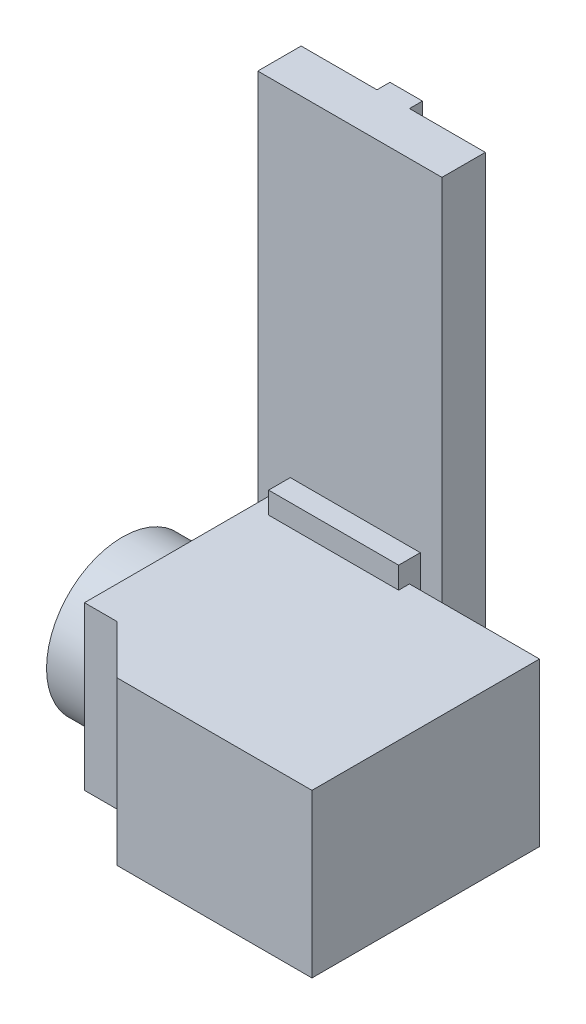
ISO-10303-21;
HEADER;
FILE_DESCRIPTION(('STEP AP214'),'2;1');
FILE_NAME('part.step','',(''),(''),'','','');
FILE_SCHEMA(('AUTOMOTIVE_DESIGN { 1 0 10303 214 1 1 1 1 }'));
ENDSEC;
DATA;
#1=APPLICATION_CONTEXT('core data for automotive mechanical design processes');
#2=APPLICATION_PROTOCOL_DEFINITION('international standard','automotive_design',2000,#1);
#3=PRODUCT_CONTEXT('',#1,'mechanical');
#4=PRODUCT('Part','Part','',(#3));
#5=PRODUCT_RELATED_PRODUCT_CATEGORY('part','',(#4));
#6=PRODUCT_DEFINITION_FORMATION('','',#4);
#7=PRODUCT_DEFINITION_CONTEXT('part definition',#1,'design');
#8=PRODUCT_DEFINITION('design','',#6,#7);
#9=PRODUCT_DEFINITION_SHAPE('','',#8);
#10=(LENGTH_UNIT() NAMED_UNIT(*) SI_UNIT(.MILLI.,.METRE.));
#11=(NAMED_UNIT(*) PLANE_ANGLE_UNIT() SI_UNIT($,.RADIAN.));
#12=(NAMED_UNIT(*) SI_UNIT($,.STERADIAN.) SOLID_ANGLE_UNIT());
#13=UNCERTAINTY_MEASURE_WITH_UNIT(LENGTH_MEASURE(1.E-05),#10,'distance_accuracy_value','');
#14=(GEOMETRIC_REPRESENTATION_CONTEXT(3) GLOBAL_UNCERTAINTY_ASSIGNED_CONTEXT((#13)) GLOBAL_UNIT_ASSIGNED_CONTEXT((#10,
#11,#12)) REPRESENTATION_CONTEXT('',''));
#15=CARTESIAN_POINT('',(0.,0.,0.));
#16=DIRECTION('',(0.,0.,1.));
#17=DIRECTION('',(1.,0.,0.));
#18=AXIS2_PLACEMENT_3D('',#15,#16,#17);
#19=CARTESIAN_POINT('',(-30.,405.,-40.));
#20=DIRECTION('',(0.,0.,-1.));
#21=DIRECTION('',(-1.,0.,0.));
#22=AXIS2_PLACEMENT_3D('',#19,#20,#21);
#23=PLANE('',#22);
#24=DIRECTION('',(0.,1.,0.));
#25=VECTOR('',#24,1.);
#26=CARTESIAN_POINT('',(40.,405.,-40.));
#27=LINE('',#26,#25);
#28=CARTESIAN_POINT('',(40.,-95.,-40.));
#29=VERTEX_POINT('',#28);
#30=CARTESIAN_POINT('',(40.,405.,-40.));
#31=VERTEX_POINT('',#30);
#32=EDGE_CURVE('E11',#29,#31,#27,.T.);
#33=ORIENTED_EDGE('',*,*,#32,.F.);
#34=DIRECTION('',(-1.,0.,0.));
#35=VECTOR('',#34,1.);
#36=CARTESIAN_POINT('',(-30.,-95.,-40.));
#37=LINE('',#36,#35);
#38=CARTESIAN_POINT('',(-30.,-95.,-40.));
#39=VERTEX_POINT('',#38);
#40=EDGE_CURVE('E185',#29,#39,#37,.T.);
#41=ORIENTED_EDGE('',*,*,#40,.T.);
#42=DIRECTION('',(0.,1.,0.));
#43=VECTOR('',#42,1.);
#44=CARTESIAN_POINT('',(-30.,-95.,-40.));
#45=LINE('',#44,#43);
#46=CARTESIAN_POINT('',(-30.,405.,-40.));
#47=VERTEX_POINT('',#46);
#48=EDGE_CURVE('E220',#39,#47,#45,.T.);
#49=ORIENTED_EDGE('',*,*,#48,.T.);
#50=DIRECTION('',(1.,0.,0.));
#51=VECTOR('',#50,1.);
#52=CARTESIAN_POINT('',(-30.,405.,-40.));
#53=LINE('',#52,#51);
#54=EDGE_CURVE('E244',#47,#31,#53,.T.);
#55=ORIENTED_EDGE('',*,*,#54,.T.);
#56=EDGE_LOOP('',(#33,#41,#49,#55));
#57=FACE_BOUND('',#56,.T.);
#58=ADVANCED_FACE('F30',(#57),#23,.T.);
#59=CARTESIAN_POINT('',(-15.,75.,175.));
#60=DIRECTION('',(1.,0.,0.));
#61=DIRECTION('',(0.,0.,-1.));
#62=AXIS2_PLACEMENT_3D('',#59,#60,#61);
#63=PLANE('',#62);
#64=DIRECTION('',(0.,-1.,0.));
#65=VECTOR('',#64,1.);
#66=CARTESIAN_POINT('',(-15.,75.,0.));
#67=LINE('',#66,#65);
#68=CARTESIAN_POINT('',(-15.,75.,0.));
#69=VERTEX_POINT('',#68);
#70=CARTESIAN_POINT('',(-15.,-75.,0.));
#71=VERTEX_POINT('',#70);
#72=EDGE_CURVE('E341',#69,#71,#67,.T.);
#73=ORIENTED_EDGE('',*,*,#72,.T.);
#74=DIRECTION('',(0.,0.,1.));
#75=VECTOR('',#74,1.);
#76=CARTESIAN_POINT('',(-15.,-75.,175.));
#77=LINE('',#76,#75);
#78=CARTESIAN_POINT('',(-15.,-75.,175.));
#79=VERTEX_POINT('',#78);
#80=EDGE_CURVE('E386',#71,#79,#77,.T.);
#81=ORIENTED_EDGE('',*,*,#80,.T.);
#82=DIRECTION('',(0.,-1.,0.));
#83=VECTOR('',#82,1.);
#84=CARTESIAN_POINT('',(-15.,75.,175.));
#85=LINE('',#84,#83);
#86=CARTESIAN_POINT('',(-15.,75.,175.));
#87=VERTEX_POINT('',#86);
#88=EDGE_CURVE('E344',#87,#79,#85,.T.);
#89=ORIENTED_EDGE('',*,*,#88,.F.);
#90=DIRECTION('',(0.,0.,1.));
#91=VECTOR('',#90,1.);
#92=CARTESIAN_POINT('',(-15.,75.,175.));
#93=LINE('',#92,#91);
#94=EDGE_CURVE('E366',#69,#87,#93,.T.);
#95=ORIENTED_EDGE('',*,*,#94,.F.);
#96=EDGE_LOOP('',(#73,#81,#89,#95));
#97=FACE_BOUND('',#96,.T.);
#98=CARTESIAN_POINT('',(-15.,0.,100.));
#99=DIRECTION('',(1.,0.,0.));
#100=DIRECTION('',(0.,0.,-1.));
#101=AXIS2_PLACEMENT_3D('',#98,#99,#100);
#102=CIRCLE('',#101,70.);
#103=CARTESIAN_POINT('',(-15.,0.,30.));
#104=VERTEX_POINT('',#103);
#105=EDGE_CURVE('E284',#104,#104,#102,.F.);
#106=ORIENTED_EDGE('',*,*,#105,.F.);
#107=EDGE_LOOP('',(#106));
#108=FACE_BOUND('',#107,.T.);
#109=ADVANCED_FACE('F418',(#97,#108),#63,.F.);
#110=CARTESIAN_POINT('',(0.,95.,20.));
#111=DIRECTION('',(1.,0.,0.));
#112=DIRECTION('',(0.,0.,-1.));
#113=AXIS2_PLACEMENT_3D('',#110,#111,#112);
#114=PLANE('',#113);
#115=DIRECTION('',(0.,0.,1.));
#116=VECTOR('',#115,1.);
#117=CARTESIAN_POINT('',(0.,-75.,20.));
#118=LINE('',#117,#116);
#119=CARTESIAN_POINT('',(0.,-75.,0.));
#120=VERTEX_POINT('',#119);
#121=CARTESIAN_POINT('',(0.,-75.,20.));
#122=VERTEX_POINT('',#121);
#123=EDGE_CURVE('E332',#120,#122,#118,.T.);
#124=ORIENTED_EDGE('',*,*,#123,.F.);
#125=DIRECTION('',(0.,-1.,0.));
#126=VECTOR('',#125,1.);
#127=CARTESIAN_POINT('',(0.,95.,0.));
#128=LINE('',#127,#126);
#129=CARTESIAN_POINT('',(0.,-95.,0.));
#130=VERTEX_POINT('',#129);
#131=EDGE_CURVE('E280',#120,#130,#128,.T.);
#132=ORIENTED_EDGE('',*,*,#131,.T.);
#133=DIRECTION('',(0.,0.,-1.));
#134=VECTOR('',#133,1.);
#135=CARTESIAN_POINT('',(0.,-95.,20.));
#136=LINE('',#135,#134);
#137=CARTESIAN_POINT('',(0.,-95.,20.));
#138=VERTEX_POINT('',#137);
#139=EDGE_CURVE('E290',#138,#130,#136,.T.);
#140=ORIENTED_EDGE('',*,*,#139,.F.);
#141=DIRECTION('',(0.,-1.,0.));
#142=VECTOR('',#141,1.);
#143=CARTESIAN_POINT('',(0.,95.,20.));
#144=LINE('',#143,#142);
#145=EDGE_CURVE('E277',#122,#138,#144,.T.);
#146=ORIENTED_EDGE('',*,*,#145,.F.);
#147=EDGE_LOOP('',(#124,#132,#140,#146));
#148=FACE_BOUND('',#147,.T.);
#149=ADVANCED_FACE('F409',(#148),#114,.F.);
#150=CARTESIAN_POINT('',(0.,-95.,20.));
#151=DIRECTION('',(0.,0.,1.));
#152=DIRECTION('',(1.,0.,0.));
#153=AXIS2_PLACEMENT_3D('',#150,#151,#152);
#154=PLANE('',#153);
#155=DIRECTION('',(0.,1.,0.));
#156=VECTOR('',#155,1.);
#157=CARTESIAN_POINT('',(120.,95.,20.));
#158=LINE('',#157,#156);
#159=CARTESIAN_POINT('',(120.,-95.,20.));
#160=VERTEX_POINT('',#159);
#161=CARTESIAN_POINT('',(120.,-75.,20.));
#162=VERTEX_POINT('',#161);
#163=EDGE_CURVE('E308',#160,#162,#158,.T.);
#164=ORIENTED_EDGE('',*,*,#163,.T.);
#165=DIRECTION('',(-1.,0.,0.));
#166=VECTOR('',#165,1.);
#167=CARTESIAN_POINT('',(0.,-75.,20.));
#168=LINE('',#167,#166);
#169=EDGE_CURVE('E338',#162,#122,#168,.T.);
#170=ORIENTED_EDGE('',*,*,#169,.T.);
#171=ORIENTED_EDGE('',*,*,#145,.T.);
#172=DIRECTION('',(1.,0.,0.));
#173=VECTOR('',#172,1.);
#174=CARTESIAN_POINT('',(0.,-95.,20.));
#175=LINE('',#174,#173);
#176=EDGE_CURVE('E305',#138,#160,#175,.T.);
#177=ORIENTED_EDGE('',*,*,#176,.T.);
#178=EDGE_LOOP('',(#164,#170,#171,#177));
#179=FACE_BOUND('',#178,.T.);
#180=ADVANCED_FACE('F424',(#179),#154,.T.);
#181=CARTESIAN_POINT('',(0.,95.,0.));
#182=VERTEX_POINT('',#181);
#183=CARTESIAN_POINT('',(0.,75.,0.));
#184=VERTEX_POINT('',#183);
#185=EDGE_CURVE('E275',#182,#184,#128,.T.);
#186=ORIENTED_EDGE('',*,*,#185,.T.);
#187=DIRECTION('',(0.,0.,1.));
#188=VECTOR('',#187,1.);
#189=CARTESIAN_POINT('',(0.,75.,20.));
#190=LINE('',#189,#188);
#191=CARTESIAN_POINT('',(0.,75.,20.));
#192=VERTEX_POINT('',#191);
#193=EDGE_CURVE('E296',#184,#192,#190,.T.);
#194=ORIENTED_EDGE('',*,*,#193,.T.);
#195=CARTESIAN_POINT('',(0.,95.,20.));
#196=VERTEX_POINT('',#195);
#197=EDGE_CURVE('E302',#196,#192,#144,.T.);
#198=ORIENTED_EDGE('',*,*,#197,.F.);
#199=DIRECTION('',(0.,0.,-1.));
#200=VECTOR('',#199,1.);
#201=CARTESIAN_POINT('',(0.,95.,20.));
#202=LINE('',#201,#200);
#203=EDGE_CURVE('E313',#196,#182,#202,.T.);
#204=ORIENTED_EDGE('',*,*,#203,.T.);
#205=EDGE_LOOP('',(#186,#194,#198,#204));
#206=FACE_BOUND('',#205,.T.);
#207=ADVANCED_FACE('F32',(#206),#114,.F.);
#208=CARTESIAN_POINT('',(0.,-95.,20.));
#209=DIRECTION('',(0.,1.,0.));
#210=DIRECTION('',(0.,0.,1.));
#211=AXIS2_PLACEMENT_3D('',#208,#209,#210);
#212=PLANE('',#211);
#213=ORIENTED_EDGE('',*,*,#40,.F.);
#214=DIRECTION('',(0.,0.,-1.));
#215=VECTOR('',#214,1.);
#216=CARTESIAN_POINT('',(40.,-95.,-52.));
#217=LINE('',#216,#215);
#218=CARTESIAN_POINT('',(40.,-95.,-52.));
#219=VERTEX_POINT('',#218);
#220=EDGE_CURVE('E178',#29,#219,#217,.T.);
#221=ORIENTED_EDGE('',*,*,#220,.T.);
#222=DIRECTION('',(1.,0.,0.));
#223=VECTOR('',#222,1.);
#224=CARTESIAN_POINT('',(70.,-95.,-52.));
#225=LINE('',#224,#223);
#226=CARTESIAN_POINT('',(70.,-95.,-52.));
#227=VERTEX_POINT('',#226);
#228=EDGE_CURVE('E183',#219,#227,#225,.T.);
#229=ORIENTED_EDGE('',*,*,#228,.T.);
#230=DIRECTION('',(0.,0.,1.));
#231=VECTOR('',#230,1.);
#232=CARTESIAN_POINT('',(70.,-95.,-32.));
#233=LINE('',#232,#231);
#234=CARTESIAN_POINT('',(70.,-95.,-40.));
#235=VERTEX_POINT('',#234);
#236=EDGE_CURVE('E197',#227,#235,#233,.T.);
#237=ORIENTED_EDGE('',*,*,#236,.T.);
#238=CARTESIAN_POINT('',(140.,-95.,-40.));
#239=VERTEX_POINT('',#238);
#240=EDGE_CURVE('E51',#239,#235,#37,.T.);
#241=ORIENTED_EDGE('',*,*,#240,.F.);
#242=DIRECTION('',(0.,0.,1.));
#243=VECTOR('',#242,1.);
#244=CARTESIAN_POINT('',(140.,-95.,-40.));
#245=LINE('',#244,#243);
#246=CARTESIAN_POINT('',(140.,-95.,0.));
#247=VERTEX_POINT('',#246);
#248=EDGE_CURVE('E236',#239,#247,#245,.T.);
#249=ORIENTED_EDGE('',*,*,#248,.T.);
#250=DIRECTION('',(-1.,0.,0.));
#251=VECTOR('',#250,1.);
#252=CARTESIAN_POINT('',(-30.,-95.,0.));
#253=LINE('',#252,#251);
#254=CARTESIAN_POINT('',(120.,-95.,0.));
#255=VERTEX_POINT('',#254);
#256=EDGE_CURVE('E226',#247,#255,#253,.T.);
#257=ORIENTED_EDGE('',*,*,#256,.T.);
#258=DIRECTION('',(0.,0.,-1.));
#259=VECTOR('',#258,1.);
#260=CARTESIAN_POINT('',(120.,-95.,20.));
#261=LINE('',#260,#259);
#262=EDGE_CURVE('E288',#160,#255,#261,.T.);
#263=ORIENTED_EDGE('',*,*,#262,.F.);
#264=ORIENTED_EDGE('',*,*,#176,.F.);
#265=ORIENTED_EDGE('',*,*,#139,.T.);
#266=CARTESIAN_POINT('',(-30.,-95.,0.));
#267=VERTEX_POINT('',#266);
#268=EDGE_CURVE('E217',#130,#267,#253,.T.);
#269=ORIENTED_EDGE('',*,*,#268,.T.);
#270=DIRECTION('',(0.,0.,1.));
#271=VECTOR('',#270,1.);
#272=CARTESIAN_POINT('',(-30.,-95.,-40.));
#273=LINE('',#272,#271);
#274=EDGE_CURVE('E239',#39,#267,#273,.T.);
#275=ORIENTED_EDGE('',*,*,#274,.F.);
#276=EDGE_LOOP('',(#213,#221,#229,#237,#241,#249,#257,#263,#264,#265,#269,#275));
#277=FACE_BOUND('',#276,.T.);
#278=ADVANCED_FACE('F180',(#277),#212,.F.);
#279=CARTESIAN_POINT('',(120.,95.,20.));
#280=DIRECTION('',(-1.,0.,0.));
#281=DIRECTION('',(0.,0.,1.));
#282=AXIS2_PLACEMENT_3D('',#279,#280,#281);
#283=PLANE('',#282);
#284=CARTESIAN_POINT('',(120.,75.,20.));
#285=VERTEX_POINT('',#284);
#286=CARTESIAN_POINT('',(120.,95.,20.));
#287=VERTEX_POINT('',#286);
#288=EDGE_CURVE('E307',#285,#287,#158,.T.);
#289=ORIENTED_EDGE('',*,*,#288,.F.);
#290=DIRECTION('',(0.,0.,-1.));
#291=VECTOR('',#290,1.);
#292=CARTESIAN_POINT('',(120.,75.,20.));
#293=LINE('',#292,#291);
#294=CARTESIAN_POINT('',(120.,75.,10.));
#295=VERTEX_POINT('',#294);
#296=EDGE_CURVE('E323',#285,#295,#293,.T.);
#297=ORIENTED_EDGE('',*,*,#296,.T.);
#298=DIRECTION('',(0.,-1.,0.));
#299=VECTOR('',#298,1.);
#300=CARTESIAN_POINT('',(120.,75.,10.));
#301=LINE('',#300,#299);
#302=CARTESIAN_POINT('',(120.,-75.,10.));
#303=VERTEX_POINT('',#302);
#304=EDGE_CURVE('E354',#295,#303,#301,.T.);
#305=ORIENTED_EDGE('',*,*,#304,.T.);
#306=DIRECTION('',(0.,0.,-1.));
#307=VECTOR('',#306,1.);
#308=CARTESIAN_POINT('',(120.,-75.,20.));
#309=LINE('',#308,#307);
#310=EDGE_CURVE('E334',#162,#303,#309,.T.);
#311=ORIENTED_EDGE('',*,*,#310,.F.);
#312=ORIENTED_EDGE('',*,*,#163,.F.);
#313=ORIENTED_EDGE('',*,*,#262,.T.);
#314=DIRECTION('',(0.,1.,0.));
#315=VECTOR('',#314,1.);
#316=CARTESIAN_POINT('',(120.,95.,0.));
#317=LINE('',#316,#315);
#318=CARTESIAN_POINT('',(120.,95.,0.));
#319=VERTEX_POINT('',#318);
#320=EDGE_CURVE('E269',#255,#319,#317,.T.);
#321=ORIENTED_EDGE('',*,*,#320,.T.);
#322=DIRECTION('',(0.,0.,-1.));
#323=VECTOR('',#322,1.);
#324=CARTESIAN_POINT('',(120.,95.,20.));
#325=LINE('',#324,#323);
#326=EDGE_CURVE('E291',#287,#319,#325,.T.);
#327=ORIENTED_EDGE('',*,*,#326,.F.);
#328=EDGE_LOOP('',(#289,#297,#305,#311,#312,#313,#321,#327));
#329=FACE_BOUND('',#328,.T.);
#330=ADVANCED_FACE('F320',(#329),#283,.F.);
#331=CARTESIAN_POINT('',(0.,95.,20.));
#332=DIRECTION('',(0.,-1.,0.));
#333=DIRECTION('',(0.,0.,-1.));
#334=AXIS2_PLACEMENT_3D('',#331,#332,#333);
#335=PLANE('',#334);
#336=DIRECTION('',(-1.,0.,0.));
#337=VECTOR('',#336,1.);
#338=CARTESIAN_POINT('',(0.,95.,0.));
#339=LINE('',#338,#337);
#340=EDGE_CURVE('E271',#319,#182,#339,.T.);
#341=ORIENTED_EDGE('',*,*,#340,.T.);
#342=ORIENTED_EDGE('',*,*,#203,.F.);
#343=DIRECTION('',(-1.,0.,0.));
#344=VECTOR('',#343,1.);
#345=CARTESIAN_POINT('',(0.,95.,20.));
#346=LINE('',#345,#344);
#347=EDGE_CURVE('E311',#287,#196,#346,.T.);
#348=ORIENTED_EDGE('',*,*,#347,.F.);
#349=ORIENTED_EDGE('',*,*,#326,.T.);
#350=EDGE_LOOP('',(#341,#342,#348,#349));
#351=FACE_BOUND('',#350,.T.);
#352=ADVANCED_FACE('F317',(#351),#335,.F.);
#353=DIRECTION('',(-1.,0.,0.));
#354=VECTOR('',#353,1.);
#355=CARTESIAN_POINT('',(0.,75.,20.));
#356=LINE('',#355,#354);
#357=EDGE_CURVE('E327',#285,#192,#356,.T.);
#358=ORIENTED_EDGE('',*,*,#357,.F.);
#359=ORIENTED_EDGE('',*,*,#288,.T.);
#360=ORIENTED_EDGE('',*,*,#347,.T.);
#361=ORIENTED_EDGE('',*,*,#197,.T.);
#362=EDGE_LOOP('',(#358,#359,#360,#361));
#363=FACE_BOUND('',#362,.T.);
#364=ADVANCED_FACE('F326',(#363),#154,.T.);
#365=CARTESIAN_POINT('',(120.,75.,0.));
#366=DIRECTION('',(0.,1.,0.));
#367=DIRECTION('',(0.,0.,1.));
#368=AXIS2_PLACEMENT_3D('',#365,#366,#367);
#369=PLANE('',#368);
#370=ORIENTED_EDGE('',*,*,#193,.F.);
#371=DIRECTION('',(-1.,0.,0.));
#372=VECTOR('',#371,1.);
#373=CARTESIAN_POINT('',(120.,75.,0.));
#374=LINE('',#373,#372);
#375=EDGE_CURVE('E368',#184,#69,#374,.T.);
#376=ORIENTED_EDGE('',*,*,#375,.T.);
#377=ORIENTED_EDGE('',*,*,#94,.T.);
#378=DIRECTION('',(1.,0.,0.));
#379=VECTOR('',#378,1.);
#380=CARTESIAN_POINT('',(15.0000000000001,75.,175.));
#381=LINE('',#380,#379);
#382=CARTESIAN_POINT('',(15.0000000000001,75.,175.));
#383=VERTEX_POINT('',#382);
#384=EDGE_CURVE('E364',#87,#383,#381,.T.);
#385=ORIENTED_EDGE('',*,*,#384,.T.);
#386=DIRECTION('',(0.707106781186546,0.,0.707106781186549));
#387=VECTOR('',#386,1.);
#388=CARTESIAN_POINT('',(60.,75.,220.));
#389=LINE('',#388,#387);
#390=CARTESIAN_POINT('',(60.,75.,220.));
#391=VERTEX_POINT('',#390);
#392=EDGE_CURVE('E362',#383,#391,#389,.T.);
#393=ORIENTED_EDGE('',*,*,#392,.T.);
#394=DIRECTION('',(1.,0.,0.));
#395=VECTOR('',#394,1.);
#396=CARTESIAN_POINT('',(240.,75.,220.));
#397=LINE('',#396,#395);
#398=CARTESIAN_POINT('',(240.,75.,220.));
#399=VERTEX_POINT('',#398);
#400=EDGE_CURVE('E360',#391,#399,#397,.T.);
#401=ORIENTED_EDGE('',*,*,#400,.T.);
#402=DIRECTION('',(0.,0.,-1.));
#403=VECTOR('',#402,1.);
#404=CARTESIAN_POINT('',(240.,75.,10.));
#405=LINE('',#404,#403);
#406=CARTESIAN_POINT('',(240.,75.,10.));
#407=VERTEX_POINT('',#406);
#408=EDGE_CURVE('E358',#399,#407,#405,.T.);
#409=ORIENTED_EDGE('',*,*,#408,.T.);
#410=DIRECTION('',(-1.,0.,0.));
#411=VECTOR('',#410,1.);
#412=CARTESIAN_POINT('',(120.,75.,10.));
#413=LINE('',#412,#411);
#414=EDGE_CURVE('E356',#407,#295,#413,.T.);
#415=ORIENTED_EDGE('',*,*,#414,.T.);
#416=ORIENTED_EDGE('',*,*,#296,.F.);
#417=ORIENTED_EDGE('',*,*,#357,.T.);
#418=EDGE_LOOP('',(#370,#376,#377,#385,#393,#401,#409,#415,#416,#417));
#419=FACE_BOUND('',#418,.T.);
#420=ADVANCED_FACE('F421',(#419),#369,.T.);
#421=CARTESIAN_POINT('',(120.,-75.,0.));
#422=DIRECTION('',(0.,1.,0.));
#423=DIRECTION('',(0.,0.,1.));
#424=AXIS2_PLACEMENT_3D('',#421,#422,#423);
#425=PLANE('',#424);
#426=DIRECTION('',(-1.,0.,0.));
#427=VECTOR('',#426,1.);
#428=CARTESIAN_POINT('',(120.,-75.,0.));
#429=LINE('',#428,#427);
#430=EDGE_CURVE('E389',#120,#71,#429,.T.);
#431=ORIENTED_EDGE('',*,*,#430,.F.);
#432=ORIENTED_EDGE('',*,*,#123,.T.);
#433=ORIENTED_EDGE('',*,*,#169,.F.);
#434=ORIENTED_EDGE('',*,*,#310,.T.);
#435=DIRECTION('',(-1.,0.,0.));
#436=VECTOR('',#435,1.);
#437=CARTESIAN_POINT('',(120.,-75.,10.));
#438=LINE('',#437,#436);
#439=CARTESIAN_POINT('',(240.,-75.,10.));
#440=VERTEX_POINT('',#439);
#441=EDGE_CURVE('E371',#440,#303,#438,.T.);
#442=ORIENTED_EDGE('',*,*,#441,.F.);
#443=DIRECTION('',(0.,0.,-1.));
#444=VECTOR('',#443,1.);
#445=CARTESIAN_POINT('',(240.,-75.,10.));
#446=LINE('',#445,#444);
#447=CARTESIAN_POINT('',(240.,-75.,220.));
#448=VERTEX_POINT('',#447);
#449=EDGE_CURVE('E374',#448,#440,#446,.T.);
#450=ORIENTED_EDGE('',*,*,#449,.F.);
#451=DIRECTION('',(1.,0.,0.));
#452=VECTOR('',#451,1.);
#453=CARTESIAN_POINT('',(240.,-75.,220.));
#454=LINE('',#453,#452);
#455=CARTESIAN_POINT('',(60.,-75.,220.));
#456=VERTEX_POINT('',#455);
#457=EDGE_CURVE('E377',#456,#448,#454,.T.);
#458=ORIENTED_EDGE('',*,*,#457,.F.);
#459=DIRECTION('',(0.707106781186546,0.,0.707106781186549));
#460=VECTOR('',#459,1.);
#461=CARTESIAN_POINT('',(60.,-75.,220.));
#462=LINE('',#461,#460);
#463=CARTESIAN_POINT('',(15.0000000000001,-75.,175.));
#464=VERTEX_POINT('',#463);
#465=EDGE_CURVE('E380',#464,#456,#462,.T.);
#466=ORIENTED_EDGE('',*,*,#465,.F.);
#467=DIRECTION('',(1.,0.,0.));
#468=VECTOR('',#467,1.);
#469=CARTESIAN_POINT('',(15.0000000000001,-75.,175.));
#470=LINE('',#469,#468);
#471=EDGE_CURVE('E383',#79,#464,#470,.T.);
#472=ORIENTED_EDGE('',*,*,#471,.F.);
#473=ORIENTED_EDGE('',*,*,#80,.F.);
#474=EDGE_LOOP('',(#431,#432,#433,#434,#442,#450,#458,#466,#472,#473));
#475=FACE_BOUND('',#474,.T.);
#476=ADVANCED_FACE('F413',(#475),#425,.F.);
#477=CARTESIAN_POINT('',(15.0000000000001,75.,175.));
#478=DIRECTION('',(0.,0.,-1.));
#479=DIRECTION('',(-1.,0.,0.));
#480=AXIS2_PLACEMENT_3D('',#477,#478,#479);
#481=PLANE('',#480);
#482=ORIENTED_EDGE('',*,*,#88,.T.);
#483=ORIENTED_EDGE('',*,*,#471,.T.);
#484=DIRECTION('',(0.,-1.,0.));
#485=VECTOR('',#484,1.);
#486=CARTESIAN_POINT('',(15.0000000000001,75.,175.));
#487=LINE('',#486,#485);
#488=EDGE_CURVE('E346',#383,#464,#487,.T.);
#489=ORIENTED_EDGE('',*,*,#488,.F.);
#490=ORIENTED_EDGE('',*,*,#384,.F.);
#491=EDGE_LOOP('',(#482,#483,#489,#490));
#492=FACE_BOUND('',#491,.T.);
#493=ADVANCED_FACE('F458',(#492),#481,.F.);
#494=CARTESIAN_POINT('',(60.,75.,220.));
#495=DIRECTION('',(0.707106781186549,0.,-0.707106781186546));
#496=DIRECTION('',(-0.707106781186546,0.,-0.707106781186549));
#497=AXIS2_PLACEMENT_3D('',#494,#495,#496);
#498=PLANE('',#497);
#499=ORIENTED_EDGE('',*,*,#488,.T.);
#500=ORIENTED_EDGE('',*,*,#465,.T.);
#501=DIRECTION('',(0.,-1.,0.));
#502=VECTOR('',#501,1.);
#503=CARTESIAN_POINT('',(60.,75.,220.));
#504=LINE('',#503,#502);
#505=EDGE_CURVE('E348',#391,#456,#504,.T.);
#506=ORIENTED_EDGE('',*,*,#505,.F.);
#507=ORIENTED_EDGE('',*,*,#392,.F.);
#508=EDGE_LOOP('',(#499,#500,#506,#507));
#509=FACE_BOUND('',#508,.T.);
#510=ADVANCED_FACE('F471',(#509),#498,.F.);
#511=CARTESIAN_POINT('',(240.,75.,220.));
#512=DIRECTION('',(0.,0.,-1.));
#513=DIRECTION('',(-1.,0.,0.));
#514=AXIS2_PLACEMENT_3D('',#511,#512,#513);
#515=PLANE('',#514);
#516=ORIENTED_EDGE('',*,*,#505,.T.);
#517=ORIENTED_EDGE('',*,*,#457,.T.);
#518=DIRECTION('',(0.,-1.,0.));
#519=VECTOR('',#518,1.);
#520=CARTESIAN_POINT('',(240.,75.,220.));
#521=LINE('',#520,#519);
#522=EDGE_CURVE('E350',#399,#448,#521,.T.);
#523=ORIENTED_EDGE('',*,*,#522,.F.);
#524=ORIENTED_EDGE('',*,*,#400,.F.);
#525=EDGE_LOOP('',(#516,#517,#523,#524));
#526=FACE_BOUND('',#525,.T.);
#527=ADVANCED_FACE('F467',(#526),#515,.F.);
#528=CARTESIAN_POINT('',(240.,75.,10.));
#529=DIRECTION('',(-1.,0.,0.));
#530=DIRECTION('',(0.,0.,1.));
#531=AXIS2_PLACEMENT_3D('',#528,#529,#530);
#532=PLANE('',#531);
#533=ORIENTED_EDGE('',*,*,#522,.T.);
#534=ORIENTED_EDGE('',*,*,#449,.T.);
#535=DIRECTION('',(0.,-1.,0.));
#536=VECTOR('',#535,1.);
#537=CARTESIAN_POINT('',(240.,75.,10.));
#538=LINE('',#537,#536);
#539=EDGE_CURVE('E352',#407,#440,#538,.T.);
#540=ORIENTED_EDGE('',*,*,#539,.F.);
#541=ORIENTED_EDGE('',*,*,#408,.F.);
#542=EDGE_LOOP('',(#533,#534,#540,#541));
#543=FACE_BOUND('',#542,.T.);
#544=ADVANCED_FACE('F463',(#543),#532,.F.);
#545=CARTESIAN_POINT('',(120.,75.,10.));
#546=DIRECTION('',(0.,0.,1.));
#547=DIRECTION('',(1.,0.,0.));
#548=AXIS2_PLACEMENT_3D('',#545,#546,#547);
#549=PLANE('',#548);
#550=ORIENTED_EDGE('',*,*,#539,.T.);
#551=ORIENTED_EDGE('',*,*,#441,.T.);
#552=ORIENTED_EDGE('',*,*,#304,.F.);
#553=ORIENTED_EDGE('',*,*,#414,.F.);
#554=EDGE_LOOP('',(#550,#551,#552,#553));
#555=FACE_BOUND('',#554,.T.);
#556=ADVANCED_FACE('F398',(#555),#549,.F.);
#557=CARTESIAN_POINT('',(-55.,0.,100.));
#558=DIRECTION('',(1.,0.,0.));
#559=DIRECTION('',(0.,0.,-1.));
#560=AXIS2_PLACEMENT_3D('',#557,#558,#559);
#561=CYLINDRICAL_SURFACE('',#560,70.);
#562=CARTESIAN_POINT('',(-55.,0.,100.));
#563=DIRECTION('',(-1.,0.,0.));
#564=DIRECTION('',(0.,0.,1.));
#565=AXIS2_PLACEMENT_3D('',#562,#563,#564);
#566=CIRCLE('',#565,70.);
#567=CARTESIAN_POINT('',(-55.,0.,170.));
#568=VERTEX_POINT('',#567);
#569=EDGE_CURVE('E232',#568,#568,#566,.T.);
#570=ORIENTED_EDGE('',*,*,#569,.F.);
#571=EDGE_LOOP('',(#570));
#572=FACE_BOUND('',#571,.T.);
#573=ORIENTED_EDGE('',*,*,#105,.T.);
#574=EDGE_LOOP('',(#573));
#575=FACE_BOUND('',#574,.T.);
#576=ADVANCED_FACE('F395',(#572,#575),#561,.T.);
#577=CARTESIAN_POINT('',(-55.,0.,100.));
#578=DIRECTION('',(-1.,0.,0.));
#579=DIRECTION('',(0.,0.,1.));
#580=AXIS2_PLACEMENT_3D('',#577,#578,#579);
#581=PLANE('',#580);
#582=ORIENTED_EDGE('',*,*,#569,.T.);
#583=EDGE_LOOP('',(#582));
#584=FACE_BOUND('',#583,.T.);
#585=ADVANCED_FACE('F393',(#584),#581,.T.);
#586=CARTESIAN_POINT('',(-30.,-95.,-40.));
#587=DIRECTION('',(1.,0.,0.));
#588=DIRECTION('',(0.,0.,-1.));
#589=AXIS2_PLACEMENT_3D('',#586,#587,#588);
#590=PLANE('',#589);
#591=DIRECTION('',(0.,1.,0.));
#592=VECTOR('',#591,1.);
#593=CARTESIAN_POINT('',(-30.,-95.,0.));
#594=LINE('',#593,#592);
#595=CARTESIAN_POINT('',(-30.,405.,0.));
#596=VERTEX_POINT('',#595);
#597=EDGE_CURVE('E210',#267,#596,#594,.T.);
#598=ORIENTED_EDGE('',*,*,#597,.T.);
#599=DIRECTION('',(0.,0.,1.));
#600=VECTOR('',#599,1.);
#601=CARTESIAN_POINT('',(-30.,405.,-40.));
#602=LINE('',#601,#600);
#603=EDGE_CURVE('E229',#47,#596,#602,.T.);
#604=ORIENTED_EDGE('',*,*,#603,.F.);
#605=ORIENTED_EDGE('',*,*,#48,.F.);
#606=ORIENTED_EDGE('',*,*,#274,.T.);
#607=EDGE_LOOP('',(#598,#604,#605,#606));
#608=FACE_BOUND('',#607,.T.);
#609=ADVANCED_FACE('F251',(#608),#590,.F.);
#610=CARTESIAN_POINT('',(-30.,405.,-40.));
#611=DIRECTION('',(0.,-1.,0.));
#612=DIRECTION('',(0.,0.,-1.));
#613=AXIS2_PLACEMENT_3D('',#610,#611,#612);
#614=PLANE('',#613);
#615=DIRECTION('',(0.,0.,1.));
#616=VECTOR('',#615,1.);
#617=CARTESIAN_POINT('',(40.,405.,-52.));
#618=LINE('',#617,#616);
#619=CARTESIAN_POINT('',(40.,405.,-52.));
#620=VERTEX_POINT('',#619);
#621=EDGE_CURVE('E193',#620,#31,#618,.T.);
#622=ORIENTED_EDGE('',*,*,#621,.T.);
#623=ORIENTED_EDGE('',*,*,#54,.F.);
#624=ORIENTED_EDGE('',*,*,#603,.T.);
#625=DIRECTION('',(1.,0.,0.));
#626=VECTOR('',#625,1.);
#627=CARTESIAN_POINT('',(-30.,405.,0.));
#628=LINE('',#627,#626);
#629=CARTESIAN_POINT('',(140.,405.,0.));
#630=VERTEX_POINT('',#629);
#631=EDGE_CURVE('E213',#596,#630,#628,.T.);
#632=ORIENTED_EDGE('',*,*,#631,.T.);
#633=DIRECTION('',(0.,0.,1.));
#634=VECTOR('',#633,1.);
#635=CARTESIAN_POINT('',(140.,405.,-40.));
#636=LINE('',#635,#634);
#637=CARTESIAN_POINT('',(140.,405.,-40.));
#638=VERTEX_POINT('',#637);
#639=EDGE_CURVE('E233',#638,#630,#636,.T.);
#640=ORIENTED_EDGE('',*,*,#639,.F.);
#641=CARTESIAN_POINT('',(70.,405.,-40.));
#642=VERTEX_POINT('',#641);
#643=EDGE_CURVE('E245',#642,#638,#53,.T.);
#644=ORIENTED_EDGE('',*,*,#643,.F.);
#645=DIRECTION('',(0.,0.,-1.));
#646=VECTOR('',#645,1.);
#647=CARTESIAN_POINT('',(70.,405.,-32.));
#648=LINE('',#647,#646);
#649=CARTESIAN_POINT('',(70.,405.,-52.));
#650=VERTEX_POINT('',#649);
#651=EDGE_CURVE('E206',#642,#650,#648,.T.);
#652=ORIENTED_EDGE('',*,*,#651,.T.);
#653=DIRECTION('',(-1.,0.,0.));
#654=VECTOR('',#653,1.);
#655=CARTESIAN_POINT('',(70.,405.,-52.));
#656=LINE('',#655,#654);
#657=EDGE_CURVE('E208',#650,#620,#656,.T.);
#658=ORIENTED_EDGE('',*,*,#657,.T.);
#659=EDGE_LOOP('',(#622,#623,#624,#632,#640,#644,#652,#658));
#660=FACE_BOUND('',#659,.T.);
#661=ADVANCED_FACE('F254',(#660),#614,.F.);
#662=CARTESIAN_POINT('',(140.,-95.,-40.));
#663=DIRECTION('',(-1.,0.,0.));
#664=DIRECTION('',(0.,0.,1.));
#665=AXIS2_PLACEMENT_3D('',#662,#663,#664);
#666=PLANE('',#665);
#667=DIRECTION('',(0.,-1.,0.));
#668=VECTOR('',#667,1.);
#669=CARTESIAN_POINT('',(140.,-95.,0.));
#670=LINE('',#669,#668);
#671=EDGE_CURVE('E215',#630,#247,#670,.T.);
#672=ORIENTED_EDGE('',*,*,#671,.T.);
#673=ORIENTED_EDGE('',*,*,#248,.F.);
#674=DIRECTION('',(0.,-1.,0.));
#675=VECTOR('',#674,1.);
#676=CARTESIAN_POINT('',(140.,-95.,-40.));
#677=LINE('',#676,#675);
#678=EDGE_CURVE('E243',#638,#239,#677,.T.);
#679=ORIENTED_EDGE('',*,*,#678,.F.);
#680=ORIENTED_EDGE('',*,*,#639,.T.);
#681=EDGE_LOOP('',(#672,#673,#679,#680));
#682=FACE_BOUND('',#681,.T.);
#683=ADVANCED_FACE('F442',(#682),#666,.F.);
#684=DIRECTION('',(0.,-1.,0.));
#685=VECTOR('',#684,1.);
#686=CARTESIAN_POINT('',(70.,405.,-40.));
#687=LINE('',#686,#685);
#688=EDGE_CURVE('E38',#642,#235,#687,.T.);
#689=ORIENTED_EDGE('',*,*,#688,.F.);
#690=ORIENTED_EDGE('',*,*,#643,.T.);
#691=ORIENTED_EDGE('',*,*,#678,.T.);
#692=ORIENTED_EDGE('',*,*,#240,.T.);
#693=EDGE_LOOP('',(#689,#690,#691,#692));
#694=FACE_BOUND('',#693,.T.);
#695=ADVANCED_FACE('F434',(#694),#23,.T.);
#696=CARTESIAN_POINT('',(-30.,405.,0.));
#697=DIRECTION('',(0.,0.,-1.));
#698=DIRECTION('',(-1.,0.,0.));
#699=AXIS2_PLACEMENT_3D('',#696,#697,#698);
#700=PLANE('',#699);
#701=ORIENTED_EDGE('',*,*,#320,.F.);
#702=ORIENTED_EDGE('',*,*,#256,.F.);
#703=ORIENTED_EDGE('',*,*,#671,.F.);
#704=ORIENTED_EDGE('',*,*,#631,.F.);
#705=ORIENTED_EDGE('',*,*,#597,.F.);
#706=ORIENTED_EDGE('',*,*,#268,.F.);
#707=ORIENTED_EDGE('',*,*,#131,.F.);
#708=ORIENTED_EDGE('',*,*,#430,.T.);
#709=ORIENTED_EDGE('',*,*,#72,.F.);
#710=ORIENTED_EDGE('',*,*,#375,.F.);
#711=ORIENTED_EDGE('',*,*,#185,.F.);
#712=ORIENTED_EDGE('',*,*,#340,.F.);
#713=EDGE_LOOP('',(#701,#702,#703,#704,#705,#706,#707,#708,#709,#710,#711,#712));
#714=FACE_BOUND('',#713,.T.);
#715=ADVANCED_FACE('F267',(#714),#700,.F.);
#716=CARTESIAN_POINT('',(40.,441.05551275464,-52.));
#717=DIRECTION('',(-1.,0.,0.));
#718=DIRECTION('',(0.,0.,1.));
#719=AXIS2_PLACEMENT_3D('',#716,#717,#718);
#720=PLANE('',#719);
#721=ORIENTED_EDGE('',*,*,#220,.F.);
#722=ORIENTED_EDGE('',*,*,#32,.T.);
#723=ORIENTED_EDGE('',*,*,#621,.F.);
#724=DIRECTION('',(0.,-1.,0.));
#725=VECTOR('',#724,1.);
#726=CARTESIAN_POINT('',(40.,441.05551275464,-52.));
#727=LINE('',#726,#725);
#728=EDGE_CURVE('E190',#620,#219,#727,.T.);
#729=ORIENTED_EDGE('',*,*,#728,.T.);
#730=EDGE_LOOP('',(#721,#722,#723,#729));
#731=FACE_BOUND('',#730,.T.);
#732=ADVANCED_FACE('F191',(#731),#720,.T.);
#733=CARTESIAN_POINT('',(70.,441.05551275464,-32.));
#734=DIRECTION('',(1.,0.,0.));
#735=DIRECTION('',(0.,0.,-1.));
#736=AXIS2_PLACEMENT_3D('',#733,#734,#735);
#737=PLANE('',#736);
#738=ORIENTED_EDGE('',*,*,#651,.F.);
#739=ORIENTED_EDGE('',*,*,#688,.T.);
#740=ORIENTED_EDGE('',*,*,#236,.F.);
#741=DIRECTION('',(0.,-1.,0.));
#742=VECTOR('',#741,1.);
#743=CARTESIAN_POINT('',(70.,441.05551275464,-52.));
#744=LINE('',#743,#742);
#745=EDGE_CURVE('E196',#650,#227,#744,.T.);
#746=ORIENTED_EDGE('',*,*,#745,.F.);
#747=EDGE_LOOP('',(#738,#739,#740,#746));
#748=FACE_BOUND('',#747,.T.);
#749=ADVANCED_FACE('F258',(#748),#737,.T.);
#750=CARTESIAN_POINT('',(70.,441.05551275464,-52.));
#751=DIRECTION('',(0.,0.,-1.));
#752=DIRECTION('',(-1.,0.,0.));
#753=AXIS2_PLACEMENT_3D('',#750,#751,#752);
#754=PLANE('',#753);
#755=ORIENTED_EDGE('',*,*,#657,.F.);
#756=ORIENTED_EDGE('',*,*,#745,.T.);
#757=ORIENTED_EDGE('',*,*,#228,.F.);
#758=ORIENTED_EDGE('',*,*,#728,.F.);
#759=EDGE_LOOP('',(#755,#756,#757,#758));
#760=FACE_BOUND('',#759,.T.);
#761=ADVANCED_FACE('F199',(#760),#754,.T.);
#762=CLOSED_SHELL('',(#58,#109,#149,#180,#207,#278,#330,#352,#364,#420,#476,#493,#510,#527,#544,
#556,#576,#585,#609,#661,#683,#695,#715,#732,#749,#761));
#763=MANIFOLD_SOLID_BREP('B2',#762);
#764=ADVANCED_BREP_SHAPE_REPRESENTATION('',(#18,#763),#14);
#765=SHAPE_DEFINITION_REPRESENTATION(#9,#764);
ENDSEC;
END-ISO-10303-21;
